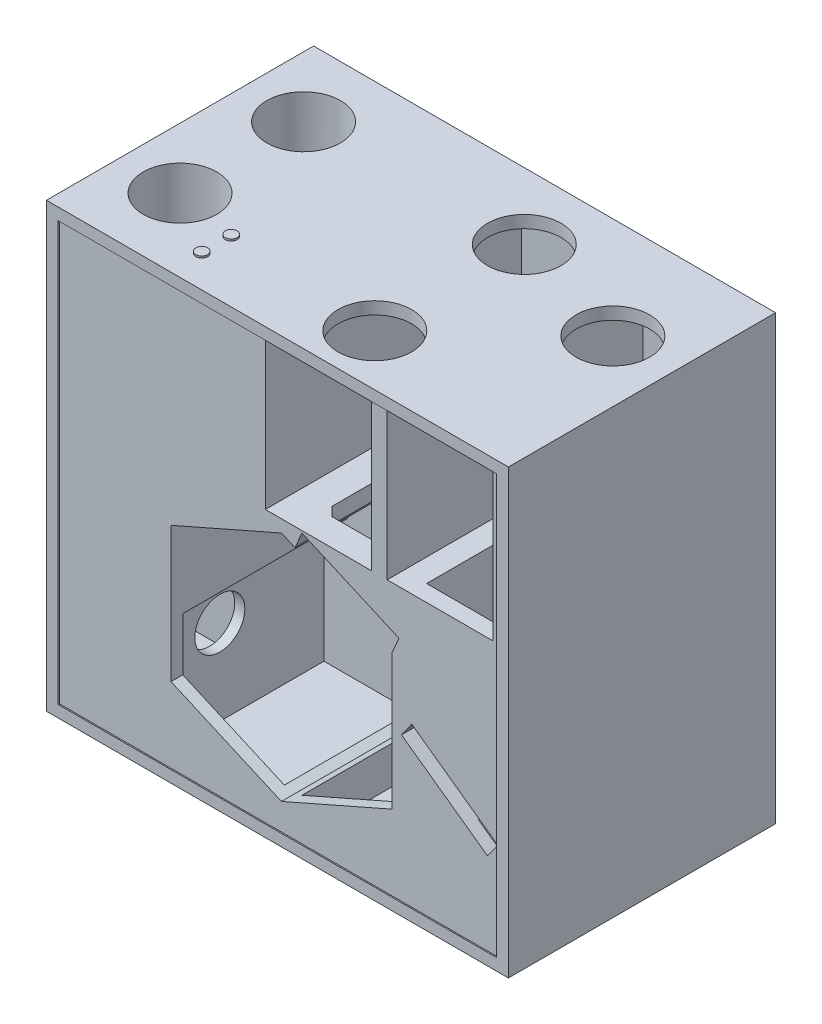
from build123d import *

# Parameters (mm, degrees)
ESQUISSE1_W                   = 785
ESQUISSE1_H                   = 454
EXTRUSION1_DEPTH              = 376
ESQUISSE3_R                   = 62.5
ENL_V_MAT_EXTRU_1_DEPTH       = 100
TROU_TARAUD_M81_D             = 6.8
TROU_TARAUD_M81_DEPTH         = 22.25
TROU_TARAUD_M81_TIP           = 2.042926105
ESQUISSE6_R                   = 10
ENL_V_MAT_EXTRU_2_DEPTH       = 3
ESQUISSE7_R                   = 10
EXTRUSION3_DEPTH              = 3
ESQUISSE8_W                   = 745
ESQUISSE8_H                   = 712
ENL_V_MAT_EXTRU_3_DEPTH       = 2
ESQUISSE9_W                   = 180
ESQUISSE9_H                   = 250
ENL_V_MAT_EXTRU_4_DEPTH       = 435
ESQUISSE11_W                  = 130
ESQUISSE11_H                  = 300
ENL_V_MAT_EXTRU_5_DEPTH       = 125
ESQUISSE12_W                  = 180
ESQUISSE12_H                  = 250
ENL_V_MAT_EXTRU_6_DEPTH       = 435
ENL_V_MAT_EXTRU_8_DEPTH       = 300
ESQUISSE15_W                  = 172.66
ESQUISSE15_H                  = 280
ESQUISSE15_W_2                = 162.673185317
ENL_V_MAT_EXTRU_9_DEPTH       = 140
ENL_V_MAT_EXTRU_10_DEPTH      = 160
ENL_V_MAT_EXTRU_10_DEPTH_BACK = 160
ESQUISSE16_W                  = 280
ESQUISSE16_H                  = 133
ESQUISSE17_W                  = 129
ESQUISSE17_H                  = 258
ENL_V_MAT_EXTRU_11_DEPTH      = 45
ENL_V_MAT_EXTRU_7_DEPTH       = 290
ESQUISSE18_W                  = 95
ESQUISSE18_H                  = 95
ESQUISSE18_H_2                = 90
ENL_V_MAT_EXTRU_12_DEPTH      = 580
ENL_V_MAT_EXTRU_13_REACH      = 773.509
ESQUISSE19_R                  = 42.5
ENL_V_MAT_EXTRU_14_REACH      = 663.019
ENL_V_MAT_EXTRU_16_DEPTH      = 410
ENL_V_MAT_EXTRU_17_REACH      = 773.509
ESQUISSE24_R                  = 42.5
ENL_V_MAT_EXTRU_18_DEPTH      = 90
ESQUISSE26_W                  = 95
ESQUISSE26_H                  = 90
EXTRUSION4_DEPTH              = 380
ESQUISSE28_W                  = 280
ESQUISSE28_H                  = 230
ENL_V_MAT_EXTRU_19_DEPTH      = 40
ENL_V_MAT_EXTRU_20_DEPTH      = 142


with BuildPart() as part:
    # Esquisse1 → Extrusion1 (new, symmetric)
    with BuildSketch(Plane(origin=(0, 0, 0), x_dir=(1, 0, 0), z_dir=(0, 1, 0))):
        Rectangle(ESQUISSE1_W, ESQUISSE1_H)
    extrude(amount=EXTRUSION1_DEPTH, both=True)

    # Esquisse3 → Enl_v. mat.-Extru.1 (cut)
    with BuildSketch(Plane(origin=(0, 376, 0), x_dir=(-1, 0, 0), z_dir=(0, 1, 0))):
        with Locations(Location((289.5, -107, 0), (0, 0, 90))):
            Circle(ESQUISSE3_R)
        with Locations(Location((289.5, 103, 0), (0, 0, 90))):
            Circle(ESQUISSE3_R)
        with Locations(Location((-78.5, -114, 0), (0, 0, 90))):
            Circle(ESQUISSE3_R)
        with Locations(Location((-78.5, 140, 0), (0, 0, 90))):
            Circle(ESQUISSE3_R)
        with Locations(Location((-288.5, -54.5, 0), (0, 0, 90))):
            Circle(ESQUISSE3_R)
    extrude(amount=-ENL_V_MAT_EXTRU_1_DEPTH, mode=Mode.SUBTRACT)

    # Trou taraud_ M81
    with Locations(Plane.XZ.offset(376)):
        with Locations((-300, 150), (300, 150), (300, -150), (-300, -150)):
            Hole(TROU_TARAUD_M81_D / 2, depth=TROU_TARAUD_M81_DEPTH)
            with Locations((0, 0, -(TROU_TARAUD_M81_DEPTH + TROU_TARAUD_M81_TIP / 2))):  # 118° drill point
                Cone(0, TROU_TARAUD_M81_D / 2, TROU_TARAUD_M81_TIP, mode=Mode.SUBTRACT)

    # Esquisse6 → Enl_v. mat.-Extru.2 (cut)
    with BuildSketch(Plane.XZ.offset(376)):
        with Locations(Location((-64.5, -62, 0), (0, 0, 270))):
            Circle(ESQUISSE6_R)
    extrude(amount=-ENL_V_MAT_EXTRU_2_DEPTH, mode=Mode.SUBTRACT)

    # Esquisse7 → Extrusion3 (add)
    with BuildSketch(Plane(origin=(0, 376, 0), x_dir=(-1, 0, 0), z_dir=(0, 1, 0))):
        with Locations(Location((182.5, 123, 0), (0, 0, 90))):
            Circle(ESQUISSE7_R)
        with Locations(Location((182.5, 173, 0), (0, 0, 90))):
            Circle(ESQUISSE7_R)
    extrude(amount=EXTRUSION3_DEPTH)

    # Esquisse8 → Enl_v. mat.-Extru.3 (cut)
    with BuildSketch(Plane.XY.offset(227)):
        Rectangle(ESQUISSE8_W, ESQUISSE8_H)
    extrude(amount=-ENL_V_MAT_EXTRU_3_DEPTH, mode=Mode.SUBTRACT)

    # Esquisse9 → Enl_v. mat.-Extru.4 (cut)
    with BuildSketch(Plane.XY.offset(225)):
        with Locations((274.5, 230)):
            Rectangle(ESQUISSE9_W, ESQUISSE9_H)
    extrude(amount=-ENL_V_MAT_EXTRU_4_DEPTH, mode=Mode.SUBTRACT)

    # Esquisse11 → Enl_v. mat.-Extru.5 (cut)
    with BuildSketch(Plane.ZY.offset(-348.5)):
        Polygon((197, 106), (197, -194), (-53, -194), (65, 106), align=None)
        with Locations((-128, -44)):
            Rectangle(ESQUISSE11_W, ESQUISSE11_H)
    extrude(amount=ENL_V_MAT_EXTRU_5_DEPTH, mode=Mode.SUBTRACT)

    # Esquisse12 → Enl_v. mat.-Extru.6 (cut)
    with BuildSketch(Plane.XY.offset(225)):
        with Locations((67.5, 230)):
            Rectangle(ESQUISSE12_W, ESQUISSE12_H)
    extrude(amount=-ENL_V_MAT_EXTRU_6_DEPTH, mode=Mode.SUBTRACT)

    # Esquisse14 → Enl_v. mat.-Extru.8 (cut)
    with BuildSketch(Plane.XY.offset(225)):
        Polygon((-182.833185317, 1.5), (4.833407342, 84), (192.5, 1.5), (192.5, -228.5), (4.833407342, -311), (-182.833185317, -228.5), align=None)
    extrude(amount=-ENL_V_MAT_EXTRU_8_DEPTH, mode=Mode.SUBTRACT)

    # Esquisse15 → Enl_v. mat.-Extru.9 (cut)
    with BuildSketch(Plane.XZ.offset(228.5)):
        with Locations((-96.503185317, 65)):
            Rectangle(ESQUISSE15_W, ESQUISSE15_H)
        with Locations((101.163407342, 65)):
            Rectangle(ESQUISSE15_W_2, ESQUISSE15_H)
    extrude(amount=ENL_V_MAT_EXTRU_9_DEPTH, mode=Mode.SUBTRACT)

    # Esquisse16 → Enl_v. mat.-Extru.10 (cut, two sides: drawn at the far end of the back side and taken through both)
    with BuildSketch(Plane.ZY.offset(-192.5).offset(-ENL_V_MAT_EXTRU_10_DEPTH_BACK)):
        with Locations((65, -302)):
            Rectangle(ESQUISSE16_W, ESQUISSE16_H)
    extrude(amount=ENL_V_MAT_EXTRU_10_DEPTH + ENL_V_MAT_EXTRU_10_DEPTH_BACK, mode=Mode.SUBTRACT)

    # Esquisse17 → Enl_v. mat.-Extru.11 (cut)
    with BuildSketch(Plane.XZ.offset(235.5)):
        with Locations((288, 76)):
            Rectangle(ESQUISSE17_W, ESQUISSE17_H)
    extrude(amount=-ENL_V_MAT_EXTRU_11_DEPTH, mode=Mode.SUBTRACT)

    # Esquisse13 → Enl_v. mat.-Extru.7 (cut)
    with BuildSketch(Plane.XY.offset(225)):
        Polygon((226.298084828, -86.633014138), (372.5, -191.633014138), (355, -216), (208.798084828, -111), align=None)
        Polygon((27.719577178, 73.93902439), (192.5, 1.5), (204.573170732, 28.963403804), (39.79274791, 101.402428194), align=None)
    extrude(amount=-ENL_V_MAT_EXTRU_7_DEPTH, mode=Mode.SUBTRACT)

    # Esquisse18 → Enl_v. mat.-Extru.12 (cut)
    with BuildSketch(Plane(origin=(0, 276, 0), x_dir=(-1, 0, 0), z_dir=(0, 1, 0))):
        with Locations((287.5, 102)):
            Rectangle(ESQUISSE18_W, ESQUISSE18_H)
        with Locations((287.5, -127)):
            Rectangle(ESQUISSE18_W, ESQUISSE18_H_2)
    extrude(amount=-ENL_V_MAT_EXTRU_12_DEPTH, mode=Mode.SUBTRACT)

    # Esquisse19 → Enl_v. mat.-Extru.13 (cut, up to next)
    with BuildSketch(Plane.ZY.offset(240), mode=Mode.PRIVATE) as enl_v_mat_extru_13_sk1:
        with Locations((102, -224)):
            Circle(ESQUISSE19_R)
    enl_v_mat_extru_13_tool1 = extrude(enl_v_mat_extru_13_sk1.sketch, amount=-ENL_V_MAT_EXTRU_13_REACH, mode=Mode.PRIVATE) & part.part
    add(enl_v_mat_extru_13_tool1.solids().sort_by_distance((-240, -224, 102))[0], mode=Mode.SUBTRACT)

    # Esquisse20 → Enl_v. mat.-Extru.14 (cut, up to next)
    with BuildSketch(Plane(origin=(0, 105, 0), x_dir=(-1, 0, 0), z_dir=(0, 1, 0)), mode=Mode.PRIVATE) as enl_v_mat_extru_14_sk1:
        Polygon((-29.5, -65), (-154.5, -65), (-154.5, 178.95334575), (-44.5, 178.95334575), (-29.5, 163.95334575), align=None)
    enl_v_mat_extru_14_tool1 = extrude(enl_v_mat_extru_14_sk1.sketch, amount=-ENL_V_MAT_EXTRU_14_REACH, mode=Mode.PRIVATE) & part.part
    add(enl_v_mat_extru_14_tool1.solids().sort_by_distance((92.212916, 105, 56.543521))[0], mode=Mode.SUBTRACT)

    # Esquisse23 → Enl_v. mat.-Extru.16 (cut)
    with BuildSketch(Plane.XY.offset(205)):
        Polygon((-222.53266938, 251.5), (-42.5, 251.5), (-42.5, 63.191788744), (-182.833185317, 1.5), (-222.53266938, 1.5), align=None)
    extrude(amount=-ENL_V_MAT_EXTRU_16_DEPTH, mode=Mode.SUBTRACT)

    # Esquisse24 → Enl_v. mat.-Extru.17 (cut, up to next)
    with BuildSketch(Plane.ZY.offset(240), mode=Mode.PRIVATE) as enl_v_mat_extru_17_sk1:
        with Locations((-127, 131)):
            Circle(ESQUISSE24_R)
    enl_v_mat_extru_17_tool1 = extrude(enl_v_mat_extru_17_sk1.sketch, amount=-ENL_V_MAT_EXTRU_17_REACH, mode=Mode.PRIVATE) & part.part
    add(enl_v_mat_extru_17_tool1.solids().sort_by_distance((-240, 131, -127))[0], mode=Mode.SUBTRACT)

    # Esquisse25 → Enl_v. mat.-Extru.18 (cut)
    with BuildSketch(Plane(origin=(0, 0, -207), x_dir=(-1, 0, 0), z_dir=(0, 0, -1))):
        Polygon((-226.298084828, -86.633014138), (42.5, 63.191788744), (182.833185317, 1.5), (182.833185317, -368.5), (-372.5, -368.5), (-372.5, -191.633014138), align=None)
    extrude(amount=-ENL_V_MAT_EXTRU_18_DEPTH, mode=Mode.SUBTRACT)

    # Esquisse26 → Extrusion4 (add)
    with BuildSketch(Plane(origin=(0, -304, 0), x_dir=(-1, 0, 0), z_dir=(0, 1, 0))):
        with Locations((287.5, -127)):
            Rectangle(ESQUISSE26_W, ESQUISSE26_H)
    extrude(amount=EXTRUSION4_DEPTH)

    # Esquisse28 → Enl_v. mat.-Extru.19 (cut)
    with BuildSketch(Plane(origin=(-182.833185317, 0, 0), x_dir=(0, 0, -1), z_dir=(1, 0, 0))):
        with Locations((-65, -253.5)):
            Rectangle(ESQUISSE28_W, ESQUISSE28_H)
    extrude(amount=-ENL_V_MAT_EXTRU_19_DEPTH, mode=Mode.SUBTRACT)

    # Esquisse29 → Enl_v. mat.-Extru.20 (cut)
    with BuildSketch(Plane.XY.offset(-65)):
        Polygon((341.867217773, -169.633014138), (324.367217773, -194), (355, -216), (372.5, -191.633014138), align=None)
    extrude(amount=-ENL_V_MAT_EXTRU_20_DEPTH, mode=Mode.SUBTRACT)


solid = part.part
